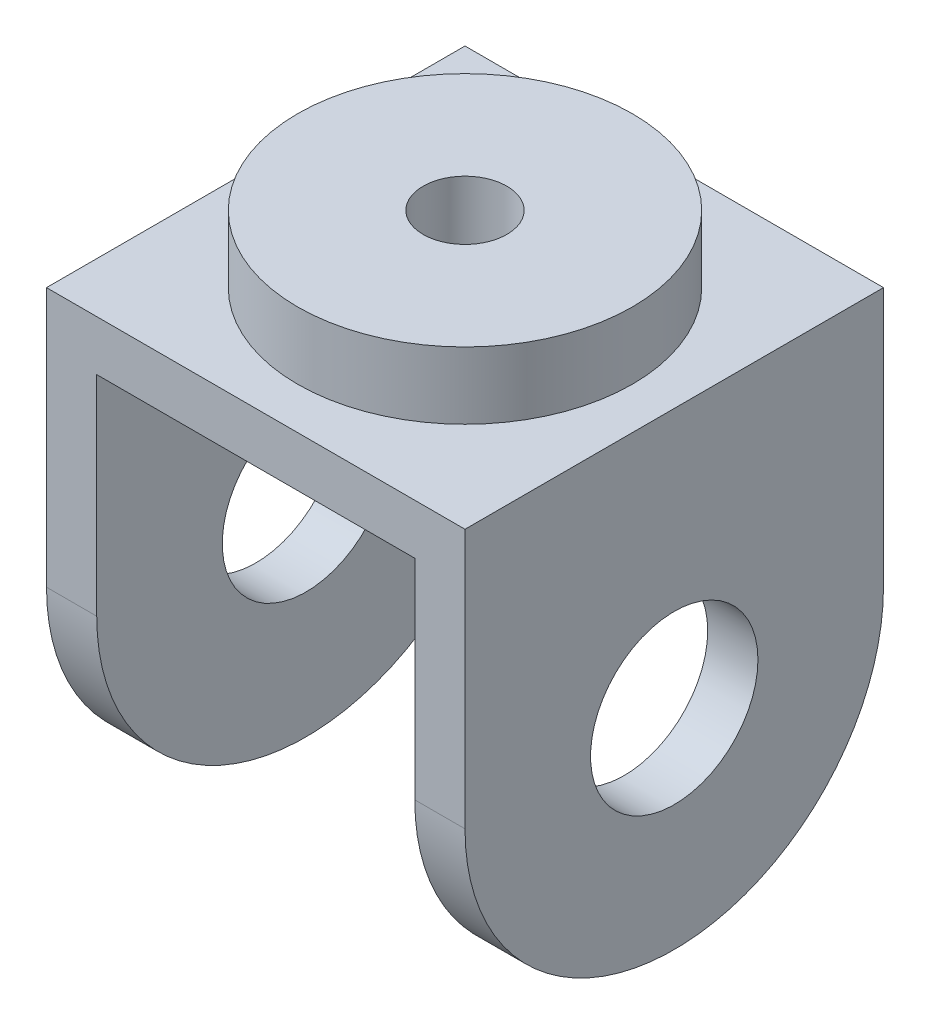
ISO-10303-21;
HEADER;
FILE_DESCRIPTION(('STEP AP214'),'2;1');
FILE_NAME('part.step','',(''),(''),'','','');
FILE_SCHEMA(('AUTOMOTIVE_DESIGN { 1 0 10303 214 1 1 1 1 }'));
ENDSEC;
DATA;
#1=APPLICATION_CONTEXT('core data for automotive mechanical design processes');
#2=APPLICATION_PROTOCOL_DEFINITION('international standard','automotive_design',2000,#1);
#3=PRODUCT_CONTEXT('',#1,'mechanical');
#4=PRODUCT('Part','Part','',(#3));
#5=PRODUCT_RELATED_PRODUCT_CATEGORY('part','',(#4));
#6=PRODUCT_DEFINITION_FORMATION('','',#4);
#7=PRODUCT_DEFINITION_CONTEXT('part definition',#1,'design');
#8=PRODUCT_DEFINITION('design','',#6,#7);
#9=PRODUCT_DEFINITION_SHAPE('','',#8);
#10=(LENGTH_UNIT() NAMED_UNIT(*) SI_UNIT(.MILLI.,.METRE.));
#11=(NAMED_UNIT(*) PLANE_ANGLE_UNIT() SI_UNIT($,.RADIAN.));
#12=(NAMED_UNIT(*) SI_UNIT($,.STERADIAN.) SOLID_ANGLE_UNIT());
#13=UNCERTAINTY_MEASURE_WITH_UNIT(LENGTH_MEASURE(1.E-05),#10,'distance_accuracy_value','');
#14=(GEOMETRIC_REPRESENTATION_CONTEXT(3) GLOBAL_UNCERTAINTY_ASSIGNED_CONTEXT((#13)) GLOBAL_UNIT_ASSIGNED_CONTEXT((#10,
#11,#12)) REPRESENTATION_CONTEXT('',''));
#15=CARTESIAN_POINT('',(0.,0.,0.));
#16=DIRECTION('',(0.,0.,1.));
#17=DIRECTION('',(1.,0.,0.));
#18=AXIS2_PLACEMENT_3D('',#15,#16,#17);
#19=CARTESIAN_POINT('',(6.,0.,0.));
#20=DIRECTION('',(1.,0.,0.));
#21=DIRECTION('',(0.,0.,-1.));
#22=AXIS2_PLACEMENT_3D('',#19,#20,#21);
#23=PLANE('',#22);
#24=DIRECTION('',(0.,1.,0.));
#25=VECTOR('',#24,1.);
#26=CARTESIAN_POINT('',(6.,0.,-25.));
#27=LINE('',#26,#25);
#28=CARTESIAN_POINT('',(6.,0.,-25.));
#29=VERTEX_POINT('',#28);
#30=CARTESIAN_POINT('',(6.,31.,-25.));
#31=VERTEX_POINT('',#30);
#32=EDGE_CURVE('E90',#29,#31,#27,.T.);
#33=ORIENTED_EDGE('',*,*,#32,.T.);
#34=DIRECTION('',(0.,0.,-1.));
#35=VECTOR('',#34,1.);
#36=CARTESIAN_POINT('',(6.,31.,25.));
#37=LINE('',#36,#35);
#38=CARTESIAN_POINT('',(6.,31.,25.));
#39=VERTEX_POINT('',#38);
#40=EDGE_CURVE('E125',#39,#31,#37,.T.);
#41=ORIENTED_EDGE('',*,*,#40,.F.);
#42=DIRECTION('',(0.,-1.,0.));
#43=VECTOR('',#42,1.);
#44=CARTESIAN_POINT('',(6.,0.,25.));
#45=LINE('',#44,#43);
#46=CARTESIAN_POINT('',(6.,0.,25.));
#47=VERTEX_POINT('',#46);
#48=EDGE_CURVE('E137',#39,#47,#45,.T.);
#49=ORIENTED_EDGE('',*,*,#48,.T.);
#50=CARTESIAN_POINT('',(6.,0.,0.));
#51=DIRECTION('',(1.,0.,0.));
#52=DIRECTION('',(0.,0.,-1.));
#53=AXIS2_PLACEMENT_3D('',#50,#51,#52);
#54=CIRCLE('',#53,25.);
#55=EDGE_CURVE('E63',#47,#29,#54,.T.);
#56=ORIENTED_EDGE('',*,*,#55,.T.);
#57=EDGE_LOOP('',(#33,#41,#49,#56));
#58=FACE_BOUND('',#57,.T.);
#59=CARTESIAN_POINT('',(6.,0.,0.));
#60=DIRECTION('',(1.,0.,0.));
#61=DIRECTION('',(0.,0.,-1.));
#62=AXIS2_PLACEMENT_3D('',#59,#60,#61);
#63=CIRCLE('',#62,10.);
#64=CARTESIAN_POINT('',(6.,0.,-10.));
#65=VERTEX_POINT('',#64);
#66=EDGE_CURVE('E99',#65,#65,#63,.T.);
#67=ORIENTED_EDGE('',*,*,#66,.F.);
#68=EDGE_LOOP('',(#67));
#69=FACE_BOUND('',#68,.T.);
#70=ADVANCED_FACE('F39',(#58,#69),#23,.T.);
#71=CARTESIAN_POINT('',(0.,0.,0.));
#72=DIRECTION('',(1.,0.,0.));
#73=DIRECTION('',(0.,0.,-1.));
#74=AXIS2_PLACEMENT_3D('',#71,#72,#73);
#75=PLANE('',#74);
#76=DIRECTION('',(0.,1.,0.));
#77=VECTOR('',#76,1.);
#78=CARTESIAN_POINT('',(0.,0.,-25.));
#79=LINE('',#78,#77);
#80=CARTESIAN_POINT('',(0.,0.,-25.));
#81=VERTEX_POINT('',#80);
#82=CARTESIAN_POINT('',(0.,25.,-25.));
#83=VERTEX_POINT('',#82);
#84=EDGE_CURVE('E94',#81,#83,#79,.T.);
#85=ORIENTED_EDGE('',*,*,#84,.F.);
#86=CARTESIAN_POINT('',(0.,0.,0.));
#87=DIRECTION('',(1.,0.,0.));
#88=DIRECTION('',(0.,0.,-1.));
#89=AXIS2_PLACEMENT_3D('',#86,#87,#88);
#90=CIRCLE('',#89,25.);
#91=CARTESIAN_POINT('',(0.,0.,25.));
#92=VERTEX_POINT('',#91);
#93=EDGE_CURVE('E79',#92,#81,#90,.T.);
#94=ORIENTED_EDGE('',*,*,#93,.F.);
#95=DIRECTION('',(0.,-1.,0.));
#96=VECTOR('',#95,1.);
#97=CARTESIAN_POINT('',(0.,0.,25.));
#98=LINE('',#97,#96);
#99=CARTESIAN_POINT('',(0.,25.,25.));
#100=VERTEX_POINT('',#99);
#101=EDGE_CURVE('E89',#100,#92,#98,.T.);
#102=ORIENTED_EDGE('',*,*,#101,.F.);
#103=DIRECTION('',(0.,0.,1.));
#104=VECTOR('',#103,1.);
#105=CARTESIAN_POINT('',(0.,25.,25.));
#106=LINE('',#105,#104);
#107=EDGE_CURVE('E97',#83,#100,#106,.T.);
#108=ORIENTED_EDGE('',*,*,#107,.F.);
#109=EDGE_LOOP('',(#85,#94,#102,#108));
#110=FACE_BOUND('',#109,.T.);
#111=CARTESIAN_POINT('',(0.,0.,0.));
#112=DIRECTION('',(1.,0.,0.));
#113=DIRECTION('',(0.,0.,-1.));
#114=AXIS2_PLACEMENT_3D('',#111,#112,#113);
#115=CIRCLE('',#114,10.);
#116=CARTESIAN_POINT('',(0.,0.,-10.));
#117=VERTEX_POINT('',#116);
#118=EDGE_CURVE('E102',#117,#117,#115,.T.);
#119=ORIENTED_EDGE('',*,*,#118,.T.);
#120=EDGE_LOOP('',(#119));
#121=FACE_BOUND('',#120,.T.);
#122=ADVANCED_FACE('F96',(#110,#121),#75,.F.);
#123=CARTESIAN_POINT('',(6.,0.,-25.));
#124=DIRECTION('',(0.,0.,1.));
#125=DIRECTION('',(0.,-1.,0.));
#126=AXIS2_PLACEMENT_3D('',#123,#124,#125);
#127=PLANE('',#126);
#128=ORIENTED_EDGE('',*,*,#84,.T.);
#129=DIRECTION('',(-1.,0.,0.));
#130=VECTOR('',#129,1.);
#131=CARTESIAN_POINT('',(-44.,25.,-25.));
#132=LINE('',#131,#130);
#133=CARTESIAN_POINT('',(-38.,25.,-25.));
#134=VERTEX_POINT('',#133);
#135=EDGE_CURVE('E117',#83,#134,#132,.T.);
#136=ORIENTED_EDGE('',*,*,#135,.T.);
#137=DIRECTION('',(0.,1.,0.));
#138=VECTOR('',#137,1.);
#139=CARTESIAN_POINT('',(-38.,0.,-25.));
#140=LINE('',#139,#138);
#141=CARTESIAN_POINT('',(-38.,0.,-25.));
#142=VERTEX_POINT('',#141);
#143=EDGE_CURVE('E168',#142,#134,#140,.T.);
#144=ORIENTED_EDGE('',*,*,#143,.F.);
#145=DIRECTION('',(1.,0.,0.));
#146=VECTOR('',#145,1.);
#147=CARTESIAN_POINT('',(-44.,0.,-25.));
#148=LINE('',#147,#146);
#149=CARTESIAN_POINT('',(-44.,0.,-25.));
#150=VERTEX_POINT('',#149);
#151=EDGE_CURVE('E124',#150,#142,#148,.T.);
#152=ORIENTED_EDGE('',*,*,#151,.F.);
#153=DIRECTION('',(0.,-1.,0.));
#154=VECTOR('',#153,1.);
#155=CARTESIAN_POINT('',(-44.,31.,-25.));
#156=LINE('',#155,#154);
#157=CARTESIAN_POINT('',(-44.,31.,-25.));
#158=VERTEX_POINT('',#157);
#159=EDGE_CURVE('E134',#158,#150,#156,.T.);
#160=ORIENTED_EDGE('',*,*,#159,.F.);
#161=DIRECTION('',(-1.,0.,0.));
#162=VECTOR('',#161,1.);
#163=CARTESIAN_POINT('',(-44.,31.,-25.));
#164=LINE('',#163,#162);
#165=EDGE_CURVE('E156',#31,#158,#164,.T.);
#166=ORIENTED_EDGE('',*,*,#165,.F.);
#167=ORIENTED_EDGE('',*,*,#32,.F.);
#168=DIRECTION('',(-1.,0.,0.));
#169=VECTOR('',#168,1.);
#170=CARTESIAN_POINT('',(6.,0.,-25.));
#171=LINE('',#170,#169);
#172=EDGE_CURVE('E85',#29,#81,#171,.T.);
#173=ORIENTED_EDGE('',*,*,#172,.T.);
#174=EDGE_LOOP('',(#128,#136,#144,#152,#160,#166,#167,#173));
#175=FACE_BOUND('',#174,.T.);
#176=ADVANCED_FACE('F41',(#175),#127,.F.);
#177=CARTESIAN_POINT('',(6.,0.,25.));
#178=DIRECTION('',(0.,0.,-1.));
#179=DIRECTION('',(-1.,0.,0.));
#180=AXIS2_PLACEMENT_3D('',#177,#178,#179);
#181=PLANE('',#180);
#182=ORIENTED_EDGE('',*,*,#101,.T.);
#183=DIRECTION('',(-1.,0.,0.));
#184=VECTOR('',#183,1.);
#185=CARTESIAN_POINT('',(6.,0.,25.));
#186=LINE('',#185,#184);
#187=EDGE_CURVE('E43',#47,#92,#186,.T.);
#188=ORIENTED_EDGE('',*,*,#187,.F.);
#189=ORIENTED_EDGE('',*,*,#48,.F.);
#190=DIRECTION('',(1.,0.,0.));
#191=VECTOR('',#190,1.);
#192=CARTESIAN_POINT('',(-44.,31.,25.));
#193=LINE('',#192,#191);
#194=CARTESIAN_POINT('',(-44.,31.,25.));
#195=VERTEX_POINT('',#194);
#196=EDGE_CURVE('E129',#195,#39,#193,.T.);
#197=ORIENTED_EDGE('',*,*,#196,.F.);
#198=DIRECTION('',(0.,-1.,0.));
#199=VECTOR('',#198,1.);
#200=CARTESIAN_POINT('',(-44.,31.,25.));
#201=LINE('',#200,#199);
#202=CARTESIAN_POINT('',(-44.,0.,25.));
#203=VERTEX_POINT('',#202);
#204=EDGE_CURVE('E135',#195,#203,#201,.T.);
#205=ORIENTED_EDGE('',*,*,#204,.T.);
#206=DIRECTION('',(1.,0.,0.));
#207=VECTOR('',#206,1.);
#208=CARTESIAN_POINT('',(-44.,0.,25.));
#209=LINE('',#208,#207);
#210=CARTESIAN_POINT('',(-38.,0.,25.));
#211=VERTEX_POINT('',#210);
#212=EDGE_CURVE('E127',#203,#211,#209,.T.);
#213=ORIENTED_EDGE('',*,*,#212,.T.);
#214=DIRECTION('',(0.,-1.,0.));
#215=VECTOR('',#214,1.);
#216=CARTESIAN_POINT('',(-38.,0.,25.));
#217=LINE('',#216,#215);
#218=CARTESIAN_POINT('',(-38.,25.,25.));
#219=VERTEX_POINT('',#218);
#220=EDGE_CURVE('E163',#219,#211,#217,.T.);
#221=ORIENTED_EDGE('',*,*,#220,.F.);
#222=DIRECTION('',(1.,0.,0.));
#223=VECTOR('',#222,1.);
#224=CARTESIAN_POINT('',(-44.,25.,25.));
#225=LINE('',#224,#223);
#226=EDGE_CURVE('E111',#219,#100,#225,.T.);
#227=ORIENTED_EDGE('',*,*,#226,.T.);
#228=EDGE_LOOP('',(#182,#188,#189,#197,#205,#213,#221,#227));
#229=FACE_BOUND('',#228,.T.);
#230=ADVANCED_FACE('F112',(#229),#181,.F.);
#231=CARTESIAN_POINT('',(6.,0.,0.));
#232=DIRECTION('',(-1.,0.,0.));
#233=DIRECTION('',(0.,0.,1.));
#234=AXIS2_PLACEMENT_3D('',#231,#232,#233);
#235=CYLINDRICAL_SURFACE('',#234,25.);
#236=ORIENTED_EDGE('',*,*,#93,.T.);
#237=ORIENTED_EDGE('',*,*,#172,.F.);
#238=ORIENTED_EDGE('',*,*,#55,.F.);
#239=ORIENTED_EDGE('',*,*,#187,.T.);
#240=EDGE_LOOP('',(#236,#237,#238,#239));
#241=FACE_BOUND('',#240,.T.);
#242=ADVANCED_FACE('F81',(#241),#235,.T.);
#243=CARTESIAN_POINT('',(6.,0.,0.));
#244=DIRECTION('',(-1.,0.,0.));
#245=DIRECTION('',(0.,0.,1.));
#246=AXIS2_PLACEMENT_3D('',#243,#244,#245);
#247=CYLINDRICAL_SURFACE('',#246,10.);
#248=ORIENTED_EDGE('',*,*,#66,.T.);
#249=EDGE_LOOP('',(#248));
#250=FACE_BOUND('',#249,.T.);
#251=ORIENTED_EDGE('',*,*,#118,.F.);
#252=EDGE_LOOP('',(#251));
#253=FACE_BOUND('',#252,.T.);
#254=ADVANCED_FACE('F216',(#250,#253),#247,.F.);
#255=CARTESIAN_POINT('',(-44.,31.,25.));
#256=DIRECTION('',(1.,0.,0.));
#257=DIRECTION('',(0.,0.,-1.));
#258=AXIS2_PLACEMENT_3D('',#255,#256,#257);
#259=PLANE('',#258);
#260=ORIENTED_EDGE('',*,*,#159,.T.);
#261=CARTESIAN_POINT('',(-44.,0.,0.));
#262=DIRECTION('',(1.,0.,0.));
#263=DIRECTION('',(0.,0.,-1.));
#264=AXIS2_PLACEMENT_3D('',#261,#262,#263);
#265=CIRCLE('',#264,25.);
#266=EDGE_CURVE('E165',#203,#150,#265,.T.);
#267=ORIENTED_EDGE('',*,*,#266,.F.);
#268=ORIENTED_EDGE('',*,*,#204,.F.);
#269=DIRECTION('',(0.,0.,1.));
#270=VECTOR('',#269,1.);
#271=CARTESIAN_POINT('',(-44.,31.,25.));
#272=LINE('',#271,#270);
#273=EDGE_CURVE('E152',#158,#195,#272,.T.);
#274=ORIENTED_EDGE('',*,*,#273,.F.);
#275=EDGE_LOOP('',(#260,#267,#268,#274));
#276=FACE_BOUND('',#275,.T.);
#277=CARTESIAN_POINT('',(-44.,0.,0.));
#278=DIRECTION('',(1.,0.,0.));
#279=DIRECTION('',(0.,0.,-1.));
#280=AXIS2_PLACEMENT_3D('',#277,#278,#279);
#281=CIRCLE('',#280,10.);
#282=CARTESIAN_POINT('',(-44.,0.,-10.));
#283=VERTEX_POINT('',#282);
#284=EDGE_CURVE('E175',#283,#283,#281,.T.);
#285=ORIENTED_EDGE('',*,*,#284,.T.);
#286=EDGE_LOOP('',(#285));
#287=FACE_BOUND('',#286,.T.);
#288=ADVANCED_FACE('F206',(#276,#287),#259,.F.);
#289=CARTESIAN_POINT('',(0.,31.,0.));
#290=DIRECTION('',(0.,-1.,0.));
#291=DIRECTION('',(0.,0.,-1.));
#292=AXIS2_PLACEMENT_3D('',#289,#290,#291);
#293=PLANE('',#292);
#294=CARTESIAN_POINT('',(-19.,31.,0.));
#295=DIRECTION('',(0.,1.,0.));
#296=DIRECTION('',(0.,0.,1.));
#297=AXIS2_PLACEMENT_3D('',#294,#295,#296);
#298=CIRCLE('',#297,20.);
#299=CARTESIAN_POINT('',(-19.,31.,20.));
#300=VERTEX_POINT('',#299);
#301=EDGE_CURVE('E11',#300,#300,#298,.T.);
#302=ORIENTED_EDGE('',*,*,#301,.F.);
#303=EDGE_LOOP('',(#302));
#304=FACE_BOUND('',#303,.T.);
#305=ORIENTED_EDGE('',*,*,#40,.T.);
#306=ORIENTED_EDGE('',*,*,#165,.T.);
#307=ORIENTED_EDGE('',*,*,#273,.T.);
#308=ORIENTED_EDGE('',*,*,#196,.T.);
#309=EDGE_LOOP('',(#305,#306,#307,#308));
#310=FACE_BOUND('',#309,.T.);
#311=ADVANCED_FACE('F147',(#304,#310),#293,.F.);
#312=CARTESIAN_POINT('',(0.,25.,0.));
#313=DIRECTION('',(0.,-1.,0.));
#314=DIRECTION('',(0.,0.,-1.));
#315=AXIS2_PLACEMENT_3D('',#312,#313,#314);
#316=PLANE('',#315);
#317=CARTESIAN_POINT('',(-19.,25.,0.));
#318=DIRECTION('',(0.,-1.,0.));
#319=DIRECTION('',(0.,0.,-1.));
#320=AXIS2_PLACEMENT_3D('',#317,#318,#319);
#321=CIRCLE('',#320,5.);
#322=CARTESIAN_POINT('',(-19.,25.,-5.));
#323=VERTEX_POINT('',#322);
#324=EDGE_CURVE('E181',#323,#323,#321,.T.);
#325=ORIENTED_EDGE('',*,*,#324,.F.);
#326=EDGE_LOOP('',(#325));
#327=FACE_BOUND('',#326,.T.);
#328=DIRECTION('',(0.,0.,1.));
#329=VECTOR('',#328,1.);
#330=CARTESIAN_POINT('',(-38.,25.,25.));
#331=LINE('',#330,#329);
#332=EDGE_CURVE('E54',#134,#219,#331,.T.);
#333=ORIENTED_EDGE('',*,*,#332,.F.);
#334=ORIENTED_EDGE('',*,*,#135,.F.);
#335=ORIENTED_EDGE('',*,*,#107,.T.);
#336=ORIENTED_EDGE('',*,*,#226,.F.);
#337=EDGE_LOOP('',(#333,#334,#335,#336));
#338=FACE_BOUND('',#337,.T.);
#339=ADVANCED_FACE('F116',(#327,#338),#316,.T.);
#340=CARTESIAN_POINT('',(-44.,0.,0.));
#341=DIRECTION('',(1.,0.,0.));
#342=DIRECTION('',(0.,0.,-1.));
#343=AXIS2_PLACEMENT_3D('',#340,#341,#342);
#344=CYLINDRICAL_SURFACE('',#343,25.);
#345=CARTESIAN_POINT('',(-38.,0.,0.));
#346=DIRECTION('',(1.,0.,0.));
#347=DIRECTION('',(0.,0.,-1.));
#348=AXIS2_PLACEMENT_3D('',#345,#346,#347);
#349=CIRCLE('',#348,25.);
#350=EDGE_CURVE('E170',#211,#142,#349,.T.);
#351=ORIENTED_EDGE('',*,*,#350,.F.);
#352=ORIENTED_EDGE('',*,*,#212,.F.);
#353=ORIENTED_EDGE('',*,*,#266,.T.);
#354=ORIENTED_EDGE('',*,*,#151,.T.);
#355=EDGE_LOOP('',(#351,#352,#353,#354));
#356=FACE_BOUND('',#355,.T.);
#357=ADVANCED_FACE('F215',(#356),#344,.T.);
#358=CARTESIAN_POINT('',(-38.,0.,0.));
#359=DIRECTION('',(-1.,0.,0.));
#360=DIRECTION('',(0.,0.,-1.));
#361=AXIS2_PLACEMENT_3D('',#358,#359,#360);
#362=PLANE('',#361);
#363=CARTESIAN_POINT('',(-38.,0.,0.));
#364=DIRECTION('',(1.,0.,0.));
#365=DIRECTION('',(0.,0.,-1.));
#366=AXIS2_PLACEMENT_3D('',#363,#364,#365);
#367=CIRCLE('',#366,10.);
#368=CARTESIAN_POINT('',(-38.,0.,-10.));
#369=VERTEX_POINT('',#368);
#370=EDGE_CURVE('E174',#369,#369,#367,.T.);
#371=ORIENTED_EDGE('',*,*,#370,.F.);
#372=EDGE_LOOP('',(#371));
#373=FACE_BOUND('',#372,.T.);
#374=ORIENTED_EDGE('',*,*,#143,.T.);
#375=ORIENTED_EDGE('',*,*,#332,.T.);
#376=ORIENTED_EDGE('',*,*,#220,.T.);
#377=ORIENTED_EDGE('',*,*,#350,.T.);
#378=EDGE_LOOP('',(#374,#375,#376,#377));
#379=FACE_BOUND('',#378,.T.);
#380=ADVANCED_FACE('F298',(#373,#379),#362,.F.);
#381=CARTESIAN_POINT('',(-44.,0.,0.));
#382=DIRECTION('',(1.,0.,0.));
#383=DIRECTION('',(0.,0.,-1.));
#384=AXIS2_PLACEMENT_3D('',#381,#382,#383);
#385=CYLINDRICAL_SURFACE('',#384,10.);
#386=ORIENTED_EDGE('',*,*,#284,.F.);
#387=EDGE_LOOP('',(#386));
#388=FACE_BOUND('',#387,.T.);
#389=ORIENTED_EDGE('',*,*,#370,.T.);
#390=EDGE_LOOP('',(#389));
#391=FACE_BOUND('',#390,.T.);
#392=ADVANCED_FACE('F203',(#388,#391),#385,.F.);
#393=CARTESIAN_POINT('',(-19.,39.,0.));
#394=DIRECTION('',(0.,-1.,0.));
#395=DIRECTION('',(0.,0.,-1.));
#396=AXIS2_PLACEMENT_3D('',#393,#394,#395);
#397=CYLINDRICAL_SURFACE('',#396,20.);
#398=CARTESIAN_POINT('',(-19.,39.,0.));
#399=DIRECTION('',(0.,1.,0.));
#400=DIRECTION('',(0.,0.,1.));
#401=AXIS2_PLACEMENT_3D('',#398,#399,#400);
#402=CIRCLE('',#401,20.);
#403=CARTESIAN_POINT('',(-19.,39.,20.));
#404=VERTEX_POINT('',#403);
#405=EDGE_CURVE('E180',#404,#404,#402,.T.);
#406=ORIENTED_EDGE('',*,*,#405,.F.);
#407=EDGE_LOOP('',(#406));
#408=FACE_BOUND('',#407,.T.);
#409=ORIENTED_EDGE('',*,*,#301,.T.);
#410=EDGE_LOOP('',(#409));
#411=FACE_BOUND('',#410,.T.);
#412=ADVANCED_FACE('F192',(#408,#411),#397,.T.);
#413=CARTESIAN_POINT('',(-19.,39.,0.));
#414=DIRECTION('',(0.,1.,0.));
#415=DIRECTION('',(0.,0.,1.));
#416=AXIS2_PLACEMENT_3D('',#413,#414,#415);
#417=PLANE('',#416);
#418=CARTESIAN_POINT('',(-19.,39.,0.));
#419=DIRECTION('',(0.,1.,0.));
#420=DIRECTION('',(0.,0.,1.));
#421=AXIS2_PLACEMENT_3D('',#418,#419,#420);
#422=CIRCLE('',#421,5.);
#423=CARTESIAN_POINT('',(-19.,39.,5.));
#424=VERTEX_POINT('',#423);
#425=EDGE_CURVE('E186',#424,#424,#422,.T.);
#426=ORIENTED_EDGE('',*,*,#425,.F.);
#427=EDGE_LOOP('',(#426));
#428=FACE_BOUND('',#427,.T.);
#429=ORIENTED_EDGE('',*,*,#405,.T.);
#430=EDGE_LOOP('',(#429));
#431=FACE_BOUND('',#430,.T.);
#432=ADVANCED_FACE('F191',(#428,#431),#417,.T.);
#433=CARTESIAN_POINT('',(-19.,-25.,0.));
#434=DIRECTION('',(0.,1.,0.));
#435=DIRECTION('',(0.,0.,1.));
#436=AXIS2_PLACEMENT_3D('',#433,#434,#435);
#437=CYLINDRICAL_SURFACE('',#436,5.);
#438=ORIENTED_EDGE('',*,*,#324,.T.);
#439=EDGE_LOOP('',(#438));
#440=FACE_BOUND('',#439,.T.);
#441=ORIENTED_EDGE('',*,*,#425,.T.);
#442=EDGE_LOOP('',(#441));
#443=FACE_BOUND('',#442,.T.);
#444=ADVANCED_FACE('F189',(#440,#443),#437,.F.);
#445=CLOSED_SHELL('',(#70,#122,#176,#230,#242,#254,#288,#311,#339,#357,#380,#392,#412,#432,#444));
#446=MANIFOLD_SOLID_BREP('B2',#445);
#447=ADVANCED_BREP_SHAPE_REPRESENTATION('',(#18,#446),#14);
#448=SHAPE_DEFINITION_REPRESENTATION(#9,#447);
ENDSEC;
END-ISO-10303-21;
